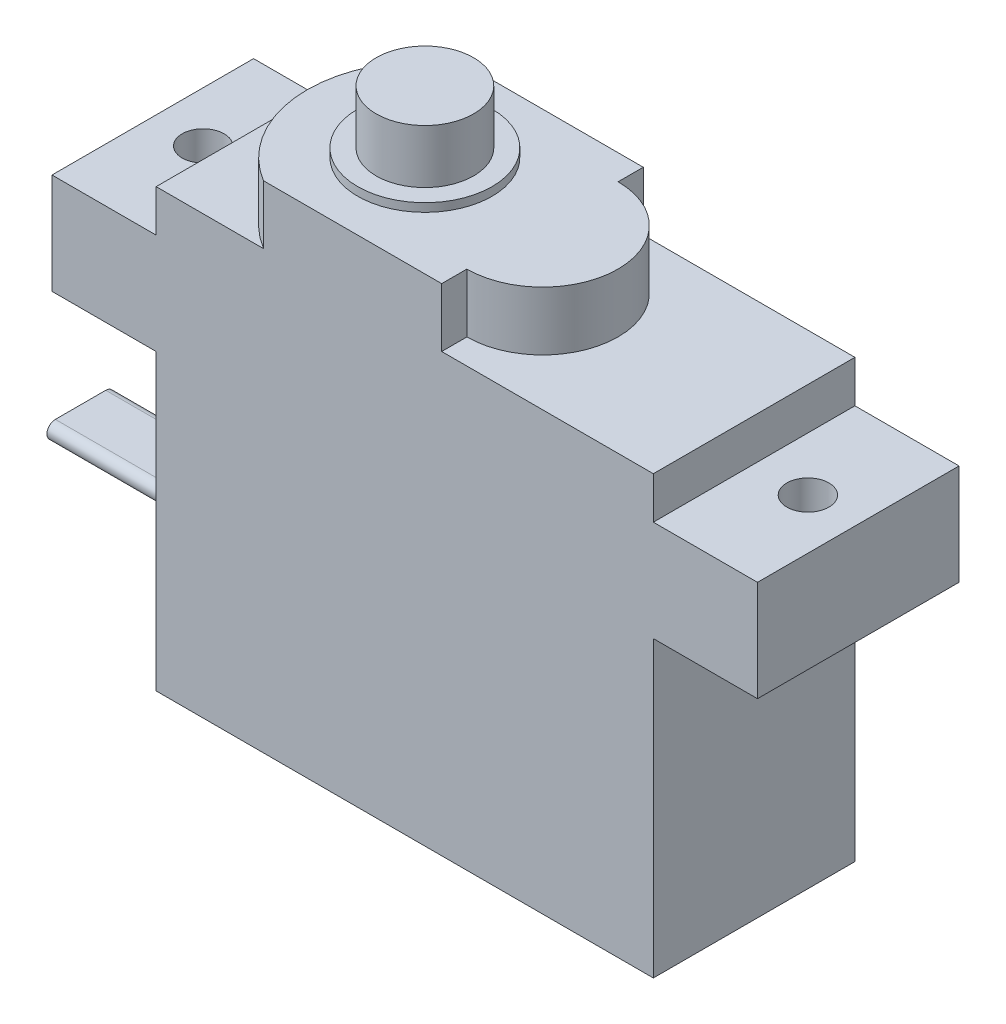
from build123d import *

# Parameters (mm, degrees)
EXTRUSION1_DEPTH        = 12
ESQUISSE2_R             = 1.25
ENL_V_MAT_EXTRU_1_DEPTH = 45.473475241
EXTRUSION2_DEPTH        = 3.5
ESQUISSE4_R             = 4
EXTRUSION3_DEPTH        = 0.5
ESQUISSE5_R             = 2.9
EXTRUSION4_DEPTH        = 3.2
EXTRUSION5_DEPTH        = 0.5
EXTRUSION6_DEPTH        = 10


with BuildPart() as part:
    # Esquisse1 → Extrusion1 (new body)
    with BuildSketch(Plane.XY):
        Polygon((35.8, 23.5), (29.6, 23.5), (29.6, 26), (0, 26), (0, 23.5), (-6.2, 23.5), (-6.2, 17.5), (0, 17.5), (0, 0), (29.6, 0), (29.6, 17.5), (35.8, 17.5), align=None)
    extrude(amount=EXTRUSION1_DEPTH)

    # Esquisse2 → Enl_v. mat.-Extru.1 (cut, through all)
    with BuildSketch(Plane(origin=(0, 23.5, 0), x_dir=(1, 0, 0), z_dir=(0, 1, 0))):
        with Locations(Location((-3.2, -6, 0), (0, 0, 270))):
            Circle(ESQUISSE2_R)
        with Locations(Location((32.8, -6, 0), (0, 0, 270))):
            Circle(ESQUISSE2_R)
    extrude(amount=-ENL_V_MAT_EXTRU_1_DEPTH, mode=Mode.SUBTRACT)

    # Esquisse3 → Extrusion2 (add)
    with BuildSketch(Plane(origin=(0, 26, 0), x_dir=(1, 0, 0), z_dir=(0, 1, 0))):
        with BuildLine():
            Line((6.394448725, 0), (17, 0))
            Line((17, 0), (17, -1.5))
            ThreePointArc((17, -1.5), (21.5, -6), (17, -10.5))
            Line((17, -10.5), (17, -12))
            Line((17, -12), (6.394448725, -12))
            ThreePointArc((6.394448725, -12), (3, -6), (6.394448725, 0))
        make_face()
    extrude(amount=EXTRUSION2_DEPTH)

    # Esquisse4 → Extrusion3 (add)
    with BuildSketch(Plane(origin=(0, 29.5, 0), x_dir=(1, 0, 0), z_dir=(0, 1, 0))):
        with Locations(Location((10, -6, 0), (0, 0, 90))):
            Circle(ESQUISSE4_R)
    extrude(amount=EXTRUSION3_DEPTH)

    # Esquisse5 → Extrusion4 (add)
    with BuildSketch(Plane(origin=(0, 30, 0), x_dir=(1, 0, 0), z_dir=(0, 1, 0))):
        with Locations(Location((10, -6, 0), (0, 0, 270))):
            Circle(ESQUISSE5_R)
    extrude(amount=EXTRUSION4_DEPTH)

    # Esquisse6 → Extrusion5 (add)
    with BuildSketch(Plane.ZY):
        with BuildLine():
            Line((4.5, 7), (7.5, 7))
            ThreePointArc((7.5, 7), (8.5, 6), (7.5, 5))
            Line((7.5, 5), (4.5, 5))
            ThreePointArc((4.5, 5), (3.5, 6), (4.5, 7))
        make_face()
    extrude(amount=EXTRUSION5_DEPTH)

    # Esquisse7 → Extrusion6 (add)
    with BuildSketch(Plane.ZY.offset(0.5)):
        with BuildLine():
            Line((4.5, 5.5), (7.5, 5.5))
            ThreePointArc((7.5, 5.5), (8, 6), (7.5, 6.5))
            Line((7.5, 6.5), (4.5, 6.5))
            ThreePointArc((4.5, 6.5), (4, 6), (4.5, 5.5))
        make_face()
    extrude(amount=EXTRUSION6_DEPTH)


solid = part.part
